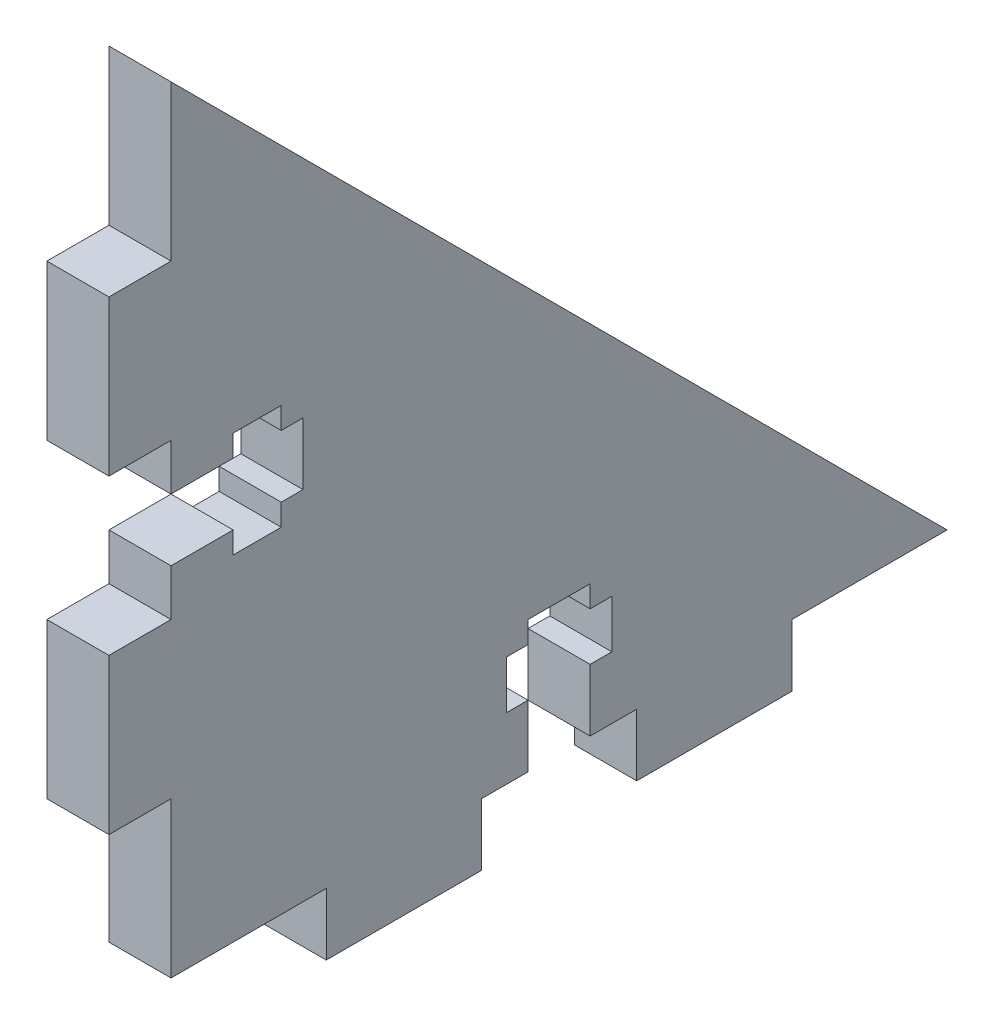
ISO-10303-21;
HEADER;
FILE_DESCRIPTION(('STEP AP214'),'2;1');
FILE_NAME('part.step','',(''),(''),'','','');
FILE_SCHEMA(('AUTOMOTIVE_DESIGN { 1 0 10303 214 1 1 1 1 }'));
ENDSEC;
DATA;
#1=APPLICATION_CONTEXT('core data for automotive mechanical design processes');
#2=APPLICATION_PROTOCOL_DEFINITION('international standard','automotive_design',2000,#1);
#3=PRODUCT_CONTEXT('',#1,'mechanical');
#4=PRODUCT('Part','Part','',(#3));
#5=PRODUCT_RELATED_PRODUCT_CATEGORY('part','',(#4));
#6=PRODUCT_DEFINITION_FORMATION('','',#4);
#7=PRODUCT_DEFINITION_CONTEXT('part definition',#1,'design');
#8=PRODUCT_DEFINITION('design','',#6,#7);
#9=PRODUCT_DEFINITION_SHAPE('','',#8);
#10=(LENGTH_UNIT() NAMED_UNIT(*) SI_UNIT(.MILLI.,.METRE.));
#11=(NAMED_UNIT(*) PLANE_ANGLE_UNIT() SI_UNIT($,.RADIAN.));
#12=(NAMED_UNIT(*) SI_UNIT($,.STERADIAN.) SOLID_ANGLE_UNIT());
#13=UNCERTAINTY_MEASURE_WITH_UNIT(LENGTH_MEASURE(1.E-05),#10,'distance_accuracy_value','');
#14=(GEOMETRIC_REPRESENTATION_CONTEXT(3) GLOBAL_UNCERTAINTY_ASSIGNED_CONTEXT((#13)) GLOBAL_UNIT_ASSIGNED_CONTEXT((#10,
#11,#12)) REPRESENTATION_CONTEXT('',''));
#15=CARTESIAN_POINT('',(0.,0.,0.));
#16=DIRECTION('',(0.,0.,1.));
#17=DIRECTION('',(1.,0.,0.));
#18=AXIS2_PLACEMENT_3D('',#15,#16,#17);
#19=CARTESIAN_POINT('',(-4.,7.1,0.));
#20=DIRECTION('',(0.,1.,0.));
#21=DIRECTION('',(0.,0.,1.));
#22=AXIS2_PLACEMENT_3D('',#19,#20,#21);
#23=PLANE('',#22);
#24=DIRECTION('',(0.,0.,1.));
#25=VECTOR('',#24,1.);
#26=CARTESIAN_POINT('',(0.,7.1,0.));
#27=LINE('',#26,#25);
#28=CARTESIAN_POINT('',(0.,7.1,-23.));
#29=VERTEX_POINT('',#28);
#30=CARTESIAN_POINT('',(0.,7.1,-21.6));
#31=VERTEX_POINT('',#30);
#32=EDGE_CURVE('E349',#29,#31,#27,.T.);
#33=ORIENTED_EDGE('',*,*,#32,.T.);
#34=DIRECTION('',(1.,0.,0.));
#35=VECTOR('',#34,1.);
#36=CARTESIAN_POINT('',(-4.,7.1,-21.6));
#37=LINE('',#36,#35);
#38=CARTESIAN_POINT('',(-4.,7.1,-21.6));
#39=VERTEX_POINT('',#38);
#40=EDGE_CURVE('E11',#39,#31,#37,.T.);
#41=ORIENTED_EDGE('',*,*,#40,.F.);
#42=DIRECTION('',(0.,0.,1.));
#43=VECTOR('',#42,1.);
#44=CARTESIAN_POINT('',(-4.,7.1,0.));
#45=LINE('',#44,#43);
#46=CARTESIAN_POINT('',(-4.,7.1,-23.));
#47=VERTEX_POINT('',#46);
#48=EDGE_CURVE('E454',#47,#39,#45,.T.);
#49=ORIENTED_EDGE('',*,*,#48,.F.);
#50=DIRECTION('',(1.,0.,0.));
#51=VECTOR('',#50,1.);
#52=CARTESIAN_POINT('',(-4.,7.1,-23.));
#53=LINE('',#52,#51);
#54=EDGE_CURVE('E44',#47,#29,#53,.T.);
#55=ORIENTED_EDGE('',*,*,#54,.T.);
#56=EDGE_LOOP('',(#33,#41,#49,#55));
#57=FACE_BOUND('',#56,.T.);
#58=ADVANCED_FACE('F41',(#57),#23,.F.);
#59=CARTESIAN_POINT('',(-4.,0.,-21.6));
#60=DIRECTION('',(0.,0.,1.));
#61=DIRECTION('',(1.,0.,0.));
#62=AXIS2_PLACEMENT_3D('',#59,#60,#61);
#63=PLANE('',#62);
#64=DIRECTION('',(0.,-1.,0.));
#65=VECTOR('',#64,1.);
#66=CARTESIAN_POINT('',(0.,0.,-21.6));
#67=LINE('',#66,#65);
#68=CARTESIAN_POINT('',(0.,4.,-21.6));
#69=VERTEX_POINT('',#68);
#70=EDGE_CURVE('E197',#31,#69,#67,.T.);
#71=ORIENTED_EDGE('',*,*,#70,.T.);
#72=DIRECTION('',(1.,0.,0.));
#73=VECTOR('',#72,1.);
#74=CARTESIAN_POINT('',(-4.,4.,-21.6));
#75=LINE('',#74,#73);
#76=CARTESIAN_POINT('',(-4.,4.,-21.6));
#77=VERTEX_POINT('',#76);
#78=EDGE_CURVE('E50',#77,#69,#75,.T.);
#79=ORIENTED_EDGE('',*,*,#78,.F.);
#80=DIRECTION('',(0.,-1.,0.));
#81=VECTOR('',#80,1.);
#82=CARTESIAN_POINT('',(-4.,0.,-21.6));
#83=LINE('',#82,#81);
#84=EDGE_CURVE('E58',#39,#77,#83,.T.);
#85=ORIENTED_EDGE('',*,*,#84,.F.);
#86=ORIENTED_EDGE('',*,*,#40,.T.);
#87=EDGE_LOOP('',(#71,#79,#85,#86));
#88=FACE_BOUND('',#87,.T.);
#89=ADVANCED_FACE('F563',(#88),#63,.F.);
#90=CARTESIAN_POINT('',(-4.,4.,0.));
#91=DIRECTION('',(0.,1.,0.));
#92=DIRECTION('',(0.,0.,1.));
#93=AXIS2_PLACEMENT_3D('',#90,#91,#92);
#94=PLANE('',#93);
#95=DIRECTION('',(0.,0.,1.));
#96=VECTOR('',#95,1.);
#97=CARTESIAN_POINT('',(0.,4.,0.));
#98=LINE('',#97,#96);
#99=CARTESIAN_POINT('',(0.,4.,-23.));
#100=VERTEX_POINT('',#99);
#101=EDGE_CURVE('E326',#100,#69,#98,.T.);
#102=ORIENTED_EDGE('',*,*,#101,.F.);
#103=DIRECTION('',(1.,0.,0.));
#104=VECTOR('',#103,1.);
#105=CARTESIAN_POINT('',(-4.,4.,-23.));
#106=LINE('',#105,#104);
#107=CARTESIAN_POINT('',(-4.,4.,-23.));
#108=VERTEX_POINT('',#107);
#109=EDGE_CURVE('E322',#108,#100,#106,.T.);
#110=ORIENTED_EDGE('',*,*,#109,.F.);
#111=DIRECTION('',(0.,0.,1.));
#112=VECTOR('',#111,1.);
#113=CARTESIAN_POINT('',(-4.,4.,0.));
#114=LINE('',#113,#112);
#115=EDGE_CURVE('E325',#108,#77,#114,.T.);
#116=ORIENTED_EDGE('',*,*,#115,.T.);
#117=ORIENTED_EDGE('',*,*,#78,.T.);
#118=EDGE_LOOP('',(#102,#110,#116,#117));
#119=FACE_BOUND('',#118,.T.);
#120=ADVANCED_FACE('F324',(#119),#94,.T.);
#121=CARTESIAN_POINT('',(-4.,0.,-23.));
#122=DIRECTION('',(0.,0.,-1.));
#123=DIRECTION('',(0.,1.,0.));
#124=AXIS2_PLACEMENT_3D('',#121,#122,#123);
#125=PLANE('',#124);
#126=DIRECTION('',(0.,1.,0.));
#127=VECTOR('',#126,1.);
#128=CARTESIAN_POINT('',(0.,0.,-23.));
#129=LINE('',#128,#127);
#130=CARTESIAN_POINT('',(0.,0.,-23.));
#131=VERTEX_POINT('',#130);
#132=EDGE_CURVE('E451',#131,#100,#129,.T.);
#133=ORIENTED_EDGE('',*,*,#132,.F.);
#134=DIRECTION('',(1.,0.,0.));
#135=VECTOR('',#134,1.);
#136=CARTESIAN_POINT('',(-4.,0.,-23.));
#137=LINE('',#136,#135);
#138=CARTESIAN_POINT('',(-4.,0.,-23.));
#139=VERTEX_POINT('',#138);
#140=EDGE_CURVE('E331',#139,#131,#137,.T.);
#141=ORIENTED_EDGE('',*,*,#140,.F.);
#142=DIRECTION('',(0.,1.,0.));
#143=VECTOR('',#142,1.);
#144=CARTESIAN_POINT('',(-4.,0.,-23.));
#145=LINE('',#144,#143);
#146=EDGE_CURVE('E336',#139,#108,#145,.T.);
#147=ORIENTED_EDGE('',*,*,#146,.T.);
#148=ORIENTED_EDGE('',*,*,#109,.T.);
#149=EDGE_LOOP('',(#133,#141,#147,#148));
#150=FACE_BOUND('',#149,.T.);
#151=ADVANCED_FACE('F338',(#150),#125,.T.);
#152=CARTESIAN_POINT('',(-4.,0.,0.));
#153=DIRECTION('',(0.,1.,0.));
#154=DIRECTION('',(0.,0.,1.));
#155=AXIS2_PLACEMENT_3D('',#152,#153,#154);
#156=PLANE('',#155);
#157=DIRECTION('',(0.,0.,1.));
#158=VECTOR('',#157,1.);
#159=CARTESIAN_POINT('',(0.,0.,0.));
#160=LINE('',#159,#158);
#161=CARTESIAN_POINT('',(0.,0.,-20.));
#162=VERTEX_POINT('',#161);
#163=EDGE_CURVE('E442',#131,#162,#160,.T.);
#164=ORIENTED_EDGE('',*,*,#163,.T.);
#165=DIRECTION('',(1.,0.,0.));
#166=VECTOR('',#165,1.);
#167=CARTESIAN_POINT('',(-4.,0.,-20.));
#168=LINE('',#167,#166);
#169=CARTESIAN_POINT('',(-4.,0.,-20.));
#170=VERTEX_POINT('',#169);
#171=EDGE_CURVE('E458',#170,#162,#168,.T.);
#172=ORIENTED_EDGE('',*,*,#171,.F.);
#173=DIRECTION('',(0.,0.,1.));
#174=VECTOR('',#173,1.);
#175=CARTESIAN_POINT('',(-4.,0.,0.));
#176=LINE('',#175,#174);
#177=EDGE_CURVE('E340',#139,#170,#176,.T.);
#178=ORIENTED_EDGE('',*,*,#177,.F.);
#179=ORIENTED_EDGE('',*,*,#140,.T.);
#180=EDGE_LOOP('',(#164,#172,#178,#179));
#181=FACE_BOUND('',#180,.T.);
#182=ADVANCED_FACE('F576',(#181),#156,.F.);
#183=CARTESIAN_POINT('',(-4.,0.,-20.));
#184=DIRECTION('',(0.,0.,1.));
#185=DIRECTION('',(0.,-1.,0.));
#186=AXIS2_PLACEMENT_3D('',#183,#184,#185);
#187=PLANE('',#186);
#188=DIRECTION('',(0.,-1.,0.));
#189=VECTOR('',#188,1.);
#190=CARTESIAN_POINT('',(0.,0.,-20.));
#191=LINE('',#190,#189);
#192=CARTESIAN_POINT('',(0.,-4.00000000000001,-20.));
#193=VERTEX_POINT('',#192);
#194=EDGE_CURVE('E448',#162,#193,#191,.T.);
#195=ORIENTED_EDGE('',*,*,#194,.T.);
#196=DIRECTION('',(1.,0.,0.));
#197=VECTOR('',#196,1.);
#198=CARTESIAN_POINT('',(-4.,-4.00000000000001,-20.));
#199=LINE('',#198,#197);
#200=CARTESIAN_POINT('',(-4.,-4.00000000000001,-20.));
#201=VERTEX_POINT('',#200);
#202=EDGE_CURVE('E461',#201,#193,#199,.T.);
#203=ORIENTED_EDGE('',*,*,#202,.F.);
#204=DIRECTION('',(0.,-1.,0.));
#205=VECTOR('',#204,1.);
#206=CARTESIAN_POINT('',(-4.,0.,-20.));
#207=LINE('',#206,#205);
#208=EDGE_CURVE('E342',#170,#201,#207,.T.);
#209=ORIENTED_EDGE('',*,*,#208,.F.);
#210=ORIENTED_EDGE('',*,*,#171,.T.);
#211=EDGE_LOOP('',(#195,#203,#209,#210));
#212=FACE_BOUND('',#211,.T.);
#213=ADVANCED_FACE('F579',(#212),#187,.F.);
#214=CARTESIAN_POINT('',(-4.,-4.00000000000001,0.));
#215=DIRECTION('',(0.,-1.,0.));
#216=DIRECTION('',(0.,0.,-1.));
#217=AXIS2_PLACEMENT_3D('',#214,#215,#216);
#218=PLANE('',#217);
#219=DIRECTION('',(0.,0.,-1.));
#220=VECTOR('',#219,1.);
#221=CARTESIAN_POINT('',(0.,-4.00000000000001,0.));
#222=LINE('',#221,#220);
#223=CARTESIAN_POINT('',(0.,-4.00000000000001,-10.));
#224=VERTEX_POINT('',#223);
#225=EDGE_CURVE('E445',#224,#193,#222,.T.);
#226=ORIENTED_EDGE('',*,*,#225,.F.);
#227=DIRECTION('',(1.,0.,0.));
#228=VECTOR('',#227,1.);
#229=CARTESIAN_POINT('',(-4.,-4.00000000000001,-10.));
#230=LINE('',#229,#228);
#231=CARTESIAN_POINT('',(-4.,-4.00000000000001,-10.));
#232=VERTEX_POINT('',#231);
#233=EDGE_CURVE('E463',#232,#224,#230,.T.);
#234=ORIENTED_EDGE('',*,*,#233,.F.);
#235=DIRECTION('',(0.,0.,-1.));
#236=VECTOR('',#235,1.);
#237=CARTESIAN_POINT('',(-4.,-4.00000000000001,0.));
#238=LINE('',#237,#236);
#239=EDGE_CURVE('E800',#232,#201,#238,.T.);
#240=ORIENTED_EDGE('',*,*,#239,.T.);
#241=ORIENTED_EDGE('',*,*,#202,.T.);
#242=EDGE_LOOP('',(#226,#234,#240,#241));
#243=FACE_BOUND('',#242,.T.);
#244=ADVANCED_FACE('F584',(#243),#218,.T.);
#245=CARTESIAN_POINT('',(-4.,0.,-9.99999999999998));
#246=DIRECTION('',(0.,0.,1.));
#247=DIRECTION('',(0.,-1.,0.));
#248=AXIS2_PLACEMENT_3D('',#245,#246,#247);
#249=PLANE('',#248);
#250=DIRECTION('',(0.,-1.,0.));
#251=VECTOR('',#250,1.);
#252=CARTESIAN_POINT('',(0.,0.,-9.99999999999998));
#253=LINE('',#252,#251);
#254=CARTESIAN_POINT('',(0.,0.,-9.99999999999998));
#255=VERTEX_POINT('',#254);
#256=EDGE_CURVE('E441',#255,#224,#253,.T.);
#257=ORIENTED_EDGE('',*,*,#256,.F.);
#258=DIRECTION('',(1.,0.,0.));
#259=VECTOR('',#258,1.);
#260=CARTESIAN_POINT('',(-4.,0.,-9.99999999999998));
#261=LINE('',#260,#259);
#262=CARTESIAN_POINT('',(-4.,0.,-9.99999999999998));
#263=VERTEX_POINT('',#262);
#264=EDGE_CURVE('E465',#263,#255,#261,.T.);
#265=ORIENTED_EDGE('',*,*,#264,.F.);
#266=DIRECTION('',(0.,-1.,0.));
#267=VECTOR('',#266,1.);
#268=CARTESIAN_POINT('',(-4.,0.,-9.99999999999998));
#269=LINE('',#268,#267);
#270=EDGE_CURVE('E798',#263,#232,#269,.T.);
#271=ORIENTED_EDGE('',*,*,#270,.T.);
#272=ORIENTED_EDGE('',*,*,#233,.T.);
#273=EDGE_LOOP('',(#257,#265,#271,#272));
#274=FACE_BOUND('',#273,.T.);
#275=ADVANCED_FACE('F588',(#274),#249,.T.);
#276=CARTESIAN_POINT('',(0.,0.,0.));
#277=VERTEX_POINT('',#276);
#278=EDGE_CURVE('E439',#255,#277,#160,.T.);
#279=ORIENTED_EDGE('',*,*,#278,.T.);
#280=DIRECTION('',(1.,0.,0.));
#281=VECTOR('',#280,1.);
#282=CARTESIAN_POINT('',(-4.,0.,0.));
#283=LINE('',#282,#281);
#284=CARTESIAN_POINT('',(-4.,0.,0.));
#285=VERTEX_POINT('',#284);
#286=EDGE_CURVE('E467',#285,#277,#283,.T.);
#287=ORIENTED_EDGE('',*,*,#286,.F.);
#288=EDGE_CURVE('E344',#263,#285,#176,.T.);
#289=ORIENTED_EDGE('',*,*,#288,.F.);
#290=ORIENTED_EDGE('',*,*,#264,.T.);
#291=EDGE_LOOP('',(#279,#287,#289,#290));
#292=FACE_BOUND('',#291,.T.);
#293=ADVANCED_FACE('F581',(#292),#156,.F.);
#294=CARTESIAN_POINT('',(-4.,0.,0.));
#295=DIRECTION('',(0.,0.,-1.));
#296=DIRECTION('',(-1.,0.,0.));
#297=AXIS2_PLACEMENT_3D('',#294,#295,#296);
#298=PLANE('',#297);
#299=DIRECTION('',(0.,1.,0.));
#300=VECTOR('',#299,1.);
#301=CARTESIAN_POINT('',(0.,0.,0.));
#302=LINE('',#301,#300);
#303=CARTESIAN_POINT('',(0.,10.,0.));
#304=VERTEX_POINT('',#303);
#305=EDGE_CURVE('E431',#277,#304,#302,.T.);
#306=ORIENTED_EDGE('',*,*,#305,.T.);
#307=DIRECTION('',(1.,0.,0.));
#308=VECTOR('',#307,1.);
#309=CARTESIAN_POINT('',(-4.,10.,0.));
#310=LINE('',#309,#308);
#311=CARTESIAN_POINT('',(-4.,10.,0.));
#312=VERTEX_POINT('',#311);
#313=EDGE_CURVE('E470',#312,#304,#310,.T.);
#314=ORIENTED_EDGE('',*,*,#313,.F.);
#315=DIRECTION('',(0.,1.,0.));
#316=VECTOR('',#315,1.);
#317=CARTESIAN_POINT('',(-4.,0.,0.));
#318=LINE('',#317,#316);
#319=EDGE_CURVE('E791',#285,#312,#318,.T.);
#320=ORIENTED_EDGE('',*,*,#319,.F.);
#321=ORIENTED_EDGE('',*,*,#286,.T.);
#322=EDGE_LOOP('',(#306,#314,#320,#321));
#323=FACE_BOUND('',#322,.T.);
#324=ADVANCED_FACE('F593',(#323),#298,.F.);
#325=CARTESIAN_POINT('',(-4.,10.,0.));
#326=DIRECTION('',(0.,1.,0.));
#327=DIRECTION('',(0.,0.,1.));
#328=AXIS2_PLACEMENT_3D('',#325,#326,#327);
#329=PLANE('',#328);
#330=DIRECTION('',(0.,0.,1.));
#331=VECTOR('',#330,1.);
#332=CARTESIAN_POINT('',(0.,10.,0.));
#333=LINE('',#332,#331);
#334=CARTESIAN_POINT('',(0.,10.,4.));
#335=VERTEX_POINT('',#334);
#336=EDGE_CURVE('E437',#304,#335,#333,.T.);
#337=ORIENTED_EDGE('',*,*,#336,.T.);
#338=DIRECTION('',(1.,0.,0.));
#339=VECTOR('',#338,1.);
#340=CARTESIAN_POINT('',(-4.,10.,4.));
#341=LINE('',#340,#339);
#342=CARTESIAN_POINT('',(-4.,10.,4.));
#343=VERTEX_POINT('',#342);
#344=EDGE_CURVE('E473',#343,#335,#341,.T.);
#345=ORIENTED_EDGE('',*,*,#344,.F.);
#346=DIRECTION('',(0.,0.,1.));
#347=VECTOR('',#346,1.);
#348=CARTESIAN_POINT('',(-4.,10.,0.));
#349=LINE('',#348,#347);
#350=EDGE_CURVE('E796',#312,#343,#349,.T.);
#351=ORIENTED_EDGE('',*,*,#350,.F.);
#352=ORIENTED_EDGE('',*,*,#313,.T.);
#353=EDGE_LOOP('',(#337,#345,#351,#352));
#354=FACE_BOUND('',#353,.T.);
#355=ADVANCED_FACE('F596',(#354),#329,.F.);
#356=CARTESIAN_POINT('',(-4.,0.,4.));
#357=DIRECTION('',(0.,0.,-1.));
#358=DIRECTION('',(-1.,0.,0.));
#359=AXIS2_PLACEMENT_3D('',#356,#357,#358);
#360=PLANE('',#359);
#361=DIRECTION('',(0.,1.,0.));
#362=VECTOR('',#361,1.);
#363=CARTESIAN_POINT('',(0.,0.,4.));
#364=LINE('',#363,#362);
#365=CARTESIAN_POINT('',(0.,20.,4.));
#366=VERTEX_POINT('',#365);
#367=EDGE_CURVE('E434',#335,#366,#364,.T.);
#368=ORIENTED_EDGE('',*,*,#367,.T.);
#369=DIRECTION('',(1.,0.,0.));
#370=VECTOR('',#369,1.);
#371=CARTESIAN_POINT('',(-4.,20.,4.));
#372=LINE('',#371,#370);
#373=CARTESIAN_POINT('',(-4.,20.,4.));
#374=VERTEX_POINT('',#373);
#375=EDGE_CURVE('E476',#374,#366,#372,.T.);
#376=ORIENTED_EDGE('',*,*,#375,.F.);
#377=DIRECTION('',(0.,1.,0.));
#378=VECTOR('',#377,1.);
#379=CARTESIAN_POINT('',(-4.,0.,4.));
#380=LINE('',#379,#378);
#381=EDGE_CURVE('E794',#343,#374,#380,.T.);
#382=ORIENTED_EDGE('',*,*,#381,.F.);
#383=ORIENTED_EDGE('',*,*,#344,.T.);
#384=EDGE_LOOP('',(#368,#376,#382,#383));
#385=FACE_BOUND('',#384,.T.);
#386=ADVANCED_FACE('F601',(#385),#360,.F.);
#387=CARTESIAN_POINT('',(-4.,20.,0.));
#388=DIRECTION('',(0.,1.,0.));
#389=DIRECTION('',(0.,0.,1.));
#390=AXIS2_PLACEMENT_3D('',#387,#388,#389);
#391=PLANE('',#390);
#392=DIRECTION('',(0.,0.,1.));
#393=VECTOR('',#392,1.);
#394=CARTESIAN_POINT('',(0.,20.,0.));
#395=LINE('',#394,#393);
#396=CARTESIAN_POINT('',(0.,20.,0.));
#397=VERTEX_POINT('',#396);
#398=EDGE_CURVE('E430',#397,#366,#395,.T.);
#399=ORIENTED_EDGE('',*,*,#398,.F.);
#400=DIRECTION('',(1.,0.,0.));
#401=VECTOR('',#400,1.);
#402=CARTESIAN_POINT('',(-4.,20.,0.));
#403=LINE('',#402,#401);
#404=CARTESIAN_POINT('',(-4.,20.,0.));
#405=VERTEX_POINT('',#404);
#406=EDGE_CURVE('E478',#405,#397,#403,.T.);
#407=ORIENTED_EDGE('',*,*,#406,.F.);
#408=DIRECTION('',(0.,0.,1.));
#409=VECTOR('',#408,1.);
#410=CARTESIAN_POINT('',(-4.,20.,0.));
#411=LINE('',#410,#409);
#412=EDGE_CURVE('E790',#405,#374,#411,.T.);
#413=ORIENTED_EDGE('',*,*,#412,.T.);
#414=ORIENTED_EDGE('',*,*,#375,.T.);
#415=EDGE_LOOP('',(#399,#407,#413,#414));
#416=FACE_BOUND('',#415,.T.);
#417=ADVANCED_FACE('F605',(#416),#391,.T.);
#418=CARTESIAN_POINT('',(0.,23.,0.));
#419=VERTEX_POINT('',#418);
#420=EDGE_CURVE('E428',#397,#419,#302,.T.);
#421=ORIENTED_EDGE('',*,*,#420,.T.);
#422=DIRECTION('',(1.,0.,0.));
#423=VECTOR('',#422,1.);
#424=CARTESIAN_POINT('',(-4.,23.,0.));
#425=LINE('',#424,#423);
#426=CARTESIAN_POINT('',(-4.,23.,0.));
#427=VERTEX_POINT('',#426);
#428=EDGE_CURVE('E480',#427,#419,#425,.T.);
#429=ORIENTED_EDGE('',*,*,#428,.F.);
#430=EDGE_CURVE('E788',#405,#427,#318,.T.);
#431=ORIENTED_EDGE('',*,*,#430,.F.);
#432=ORIENTED_EDGE('',*,*,#406,.T.);
#433=EDGE_LOOP('',(#421,#429,#431,#432));
#434=FACE_BOUND('',#433,.T.);
#435=ADVANCED_FACE('F598',(#434),#298,.F.);
#436=CARTESIAN_POINT('',(-4.,23.,0.));
#437=DIRECTION('',(0.,-1.,0.));
#438=DIRECTION('',(0.,0.,-1.));
#439=AXIS2_PLACEMENT_3D('',#436,#437,#438);
#440=PLANE('',#439);
#441=DIRECTION('',(0.,0.,-1.));
#442=VECTOR('',#441,1.);
#443=CARTESIAN_POINT('',(0.,23.,0.));
#444=LINE('',#443,#442);
#445=CARTESIAN_POINT('',(0.,23.,-4.));
#446=VERTEX_POINT('',#445);
#447=EDGE_CURVE('E426',#419,#446,#444,.T.);
#448=ORIENTED_EDGE('',*,*,#447,.T.);
#449=DIRECTION('',(1.,0.,0.));
#450=VECTOR('',#449,1.);
#451=CARTESIAN_POINT('',(-4.,23.,-4.));
#452=LINE('',#451,#450);
#453=CARTESIAN_POINT('',(-4.,23.,-4.));
#454=VERTEX_POINT('',#453);
#455=EDGE_CURVE('E483',#454,#446,#452,.T.);
#456=ORIENTED_EDGE('',*,*,#455,.F.);
#457=DIRECTION('',(0.,0.,-1.));
#458=VECTOR('',#457,1.);
#459=CARTESIAN_POINT('',(-4.,23.,0.));
#460=LINE('',#459,#458);
#461=EDGE_CURVE('E786',#427,#454,#460,.T.);
#462=ORIENTED_EDGE('',*,*,#461,.F.);
#463=ORIENTED_EDGE('',*,*,#428,.T.);
#464=EDGE_LOOP('',(#448,#456,#462,#463));
#465=FACE_BOUND('',#464,.T.);
#466=ADVANCED_FACE('F610',(#465),#440,.F.);
#467=CARTESIAN_POINT('',(-4.,0.,-4.));
#468=DIRECTION('',(0.,0.,1.));
#469=DIRECTION('',(1.,0.,0.));
#470=AXIS2_PLACEMENT_3D('',#467,#468,#469);
#471=PLANE('',#470);
#472=DIRECTION('',(0.,-1.,0.));
#473=VECTOR('',#472,1.);
#474=CARTESIAN_POINT('',(0.,0.,-4.));
#475=LINE('',#474,#473);
#476=CARTESIAN_POINT('',(0.,21.6,-4.));
#477=VERTEX_POINT('',#476);
#478=EDGE_CURVE('E424',#446,#477,#475,.T.);
#479=ORIENTED_EDGE('',*,*,#478,.T.);
#480=DIRECTION('',(1.,0.,0.));
#481=VECTOR('',#480,1.);
#482=CARTESIAN_POINT('',(-4.,21.6,-4.));
#483=LINE('',#482,#481);
#484=CARTESIAN_POINT('',(-4.,21.6,-4.));
#485=VERTEX_POINT('',#484);
#486=EDGE_CURVE('E486',#485,#477,#483,.T.);
#487=ORIENTED_EDGE('',*,*,#486,.F.);
#488=DIRECTION('',(0.,-1.,0.));
#489=VECTOR('',#488,1.);
#490=CARTESIAN_POINT('',(-4.,0.,-4.));
#491=LINE('',#490,#489);
#492=EDGE_CURVE('E784',#454,#485,#491,.T.);
#493=ORIENTED_EDGE('',*,*,#492,.F.);
#494=ORIENTED_EDGE('',*,*,#455,.T.);
#495=EDGE_LOOP('',(#479,#487,#493,#494));
#496=FACE_BOUND('',#495,.T.);
#497=ADVANCED_FACE('F613',(#496),#471,.F.);
#498=CARTESIAN_POINT('',(-4.,21.6,0.));
#499=DIRECTION('',(0.,-1.,0.));
#500=DIRECTION('',(0.,0.,-1.));
#501=AXIS2_PLACEMENT_3D('',#498,#499,#500);
#502=PLANE('',#501);
#503=DIRECTION('',(0.,0.,-1.));
#504=VECTOR('',#503,1.);
#505=CARTESIAN_POINT('',(0.,21.6,0.));
#506=LINE('',#505,#504);
#507=CARTESIAN_POINT('',(0.,21.6,-7.1));
#508=VERTEX_POINT('',#507);
#509=EDGE_CURVE('E421',#477,#508,#506,.T.);
#510=ORIENTED_EDGE('',*,*,#509,.T.);
#511=DIRECTION('',(1.,0.,0.));
#512=VECTOR('',#511,1.);
#513=CARTESIAN_POINT('',(-4.,21.6,-7.1));
#514=LINE('',#513,#512);
#515=CARTESIAN_POINT('',(-4.,21.6,-7.1));
#516=VERTEX_POINT('',#515);
#517=EDGE_CURVE('E489',#516,#508,#514,.T.);
#518=ORIENTED_EDGE('',*,*,#517,.F.);
#519=DIRECTION('',(0.,0.,-1.));
#520=VECTOR('',#519,1.);
#521=CARTESIAN_POINT('',(-4.,21.6,0.));
#522=LINE('',#521,#520);
#523=EDGE_CURVE('E782',#485,#516,#522,.T.);
#524=ORIENTED_EDGE('',*,*,#523,.F.);
#525=ORIENTED_EDGE('',*,*,#486,.T.);
#526=EDGE_LOOP('',(#510,#518,#524,#525));
#527=FACE_BOUND('',#526,.T.);
#528=ADVANCED_FACE('F617',(#527),#502,.F.);
#529=CARTESIAN_POINT('',(-4.,0.,-7.1));
#530=DIRECTION('',(0.,0.,1.));
#531=DIRECTION('',(1.,0.,0.));
#532=AXIS2_PLACEMENT_3D('',#529,#530,#531);
#533=PLANE('',#532);
#534=DIRECTION('',(0.,-1.,0.));
#535=VECTOR('',#534,1.);
#536=CARTESIAN_POINT('',(0.,0.,-7.1));
#537=LINE('',#536,#535);
#538=CARTESIAN_POINT('',(0.,23.,-7.1));
#539=VERTEX_POINT('',#538);
#540=EDGE_CURVE('E418',#539,#508,#537,.T.);
#541=ORIENTED_EDGE('',*,*,#540,.F.);
#542=DIRECTION('',(1.,0.,0.));
#543=VECTOR('',#542,1.);
#544=CARTESIAN_POINT('',(-4.,23.,-7.1));
#545=LINE('',#544,#543);
#546=CARTESIAN_POINT('',(-4.,23.,-7.1));
#547=VERTEX_POINT('',#546);
#548=EDGE_CURVE('E491',#547,#539,#545,.T.);
#549=ORIENTED_EDGE('',*,*,#548,.F.);
#550=DIRECTION('',(0.,-1.,0.));
#551=VECTOR('',#550,1.);
#552=CARTESIAN_POINT('',(-4.,0.,-7.1));
#553=LINE('',#552,#551);
#554=EDGE_CURVE('E779',#547,#516,#553,.T.);
#555=ORIENTED_EDGE('',*,*,#554,.T.);
#556=ORIENTED_EDGE('',*,*,#517,.T.);
#557=EDGE_LOOP('',(#541,#549,#555,#556));
#558=FACE_BOUND('',#557,.T.);
#559=ADVANCED_FACE('F621',(#558),#533,.T.);
#560=CARTESIAN_POINT('',(-4.,23.,0.));
#561=DIRECTION('',(0.,-1.,0.));
#562=DIRECTION('',(0.,0.,-1.));
#563=AXIS2_PLACEMENT_3D('',#560,#561,#562);
#564=PLANE('',#563);
#565=DIRECTION('',(0.,0.,-1.));
#566=VECTOR('',#565,1.);
#567=CARTESIAN_POINT('',(0.,23.,0.));
#568=LINE('',#567,#566);
#569=CARTESIAN_POINT('',(0.,23.,-8.5));
#570=VERTEX_POINT('',#569);
#571=EDGE_CURVE('E415',#539,#570,#568,.T.);
#572=ORIENTED_EDGE('',*,*,#571,.T.);
#573=DIRECTION('',(1.,0.,0.));
#574=VECTOR('',#573,1.);
#575=CARTESIAN_POINT('',(-4.,23.,-8.5));
#576=LINE('',#575,#574);
#577=CARTESIAN_POINT('',(-4.,23.,-8.5));
#578=VERTEX_POINT('',#577);
#579=EDGE_CURVE('E493',#578,#570,#576,.T.);
#580=ORIENTED_EDGE('',*,*,#579,.F.);
#581=DIRECTION('',(0.,0.,-1.));
#582=VECTOR('',#581,1.);
#583=CARTESIAN_POINT('',(-4.,23.,0.));
#584=LINE('',#583,#582);
#585=EDGE_CURVE('E777',#547,#578,#584,.T.);
#586=ORIENTED_EDGE('',*,*,#585,.F.);
#587=ORIENTED_EDGE('',*,*,#548,.T.);
#588=EDGE_LOOP('',(#572,#580,#586,#587));
#589=FACE_BOUND('',#588,.T.);
#590=ADVANCED_FACE('F625',(#589),#564,.F.);
#591=CARTESIAN_POINT('',(-4.,0.,-8.5));
#592=DIRECTION('',(0.,0.,1.));
#593=DIRECTION('',(1.,0.,0.));
#594=AXIS2_PLACEMENT_3D('',#591,#592,#593);
#595=PLANE('',#594);
#596=DIRECTION('',(0.,-1.,0.));
#597=VECTOR('',#596,1.);
#598=CARTESIAN_POINT('',(0.,0.,-8.5));
#599=LINE('',#598,#597);
#600=CARTESIAN_POINT('',(0.,27.,-8.5));
#601=VERTEX_POINT('',#600);
#602=EDGE_CURVE('E412',#601,#570,#599,.T.);
#603=ORIENTED_EDGE('',*,*,#602,.F.);
#604=DIRECTION('',(1.,0.,0.));
#605=VECTOR('',#604,1.);
#606=CARTESIAN_POINT('',(-4.,27.,-8.5));
#607=LINE('',#606,#605);
#608=CARTESIAN_POINT('',(-4.,27.,-8.5));
#609=VERTEX_POINT('',#608);
#610=EDGE_CURVE('E495',#609,#601,#607,.T.);
#611=ORIENTED_EDGE('',*,*,#610,.F.);
#612=DIRECTION('',(0.,-1.,0.));
#613=VECTOR('',#612,1.);
#614=CARTESIAN_POINT('',(-4.,0.,-8.5));
#615=LINE('',#614,#613);
#616=EDGE_CURVE('E774',#609,#578,#615,.T.);
#617=ORIENTED_EDGE('',*,*,#616,.T.);
#618=ORIENTED_EDGE('',*,*,#579,.T.);
#619=EDGE_LOOP('',(#603,#611,#617,#618));
#620=FACE_BOUND('',#619,.T.);
#621=ADVANCED_FACE('F629',(#620),#595,.T.);
#622=CARTESIAN_POINT('',(-4.,27.,0.));
#623=DIRECTION('',(0.,-1.,0.));
#624=DIRECTION('',(0.,0.,-1.));
#625=AXIS2_PLACEMENT_3D('',#622,#623,#624);
#626=PLANE('',#625);
#627=DIRECTION('',(0.,0.,-1.));
#628=VECTOR('',#627,1.);
#629=CARTESIAN_POINT('',(0.,27.,0.));
#630=LINE('',#629,#628);
#631=CARTESIAN_POINT('',(0.,27.,-7.1));
#632=VERTEX_POINT('',#631);
#633=EDGE_CURVE('E409',#632,#601,#630,.T.);
#634=ORIENTED_EDGE('',*,*,#633,.F.);
#635=DIRECTION('',(1.,0.,0.));
#636=VECTOR('',#635,1.);
#637=CARTESIAN_POINT('',(-4.,27.,-7.1));
#638=LINE('',#637,#636);
#639=CARTESIAN_POINT('',(-4.,27.,-7.1));
#640=VERTEX_POINT('',#639);
#641=EDGE_CURVE('E497',#640,#632,#638,.T.);
#642=ORIENTED_EDGE('',*,*,#641,.F.);
#643=DIRECTION('',(0.,0.,-1.));
#644=VECTOR('',#643,1.);
#645=CARTESIAN_POINT('',(-4.,27.,0.));
#646=LINE('',#645,#644);
#647=EDGE_CURVE('E771',#640,#609,#646,.T.);
#648=ORIENTED_EDGE('',*,*,#647,.T.);
#649=ORIENTED_EDGE('',*,*,#610,.T.);
#650=EDGE_LOOP('',(#634,#642,#648,#649));
#651=FACE_BOUND('',#650,.T.);
#652=ADVANCED_FACE('F633',(#651),#626,.T.);
#653=CARTESIAN_POINT('',(-4.,0.,-7.1));
#654=DIRECTION('',(0.,0.,1.));
#655=DIRECTION('',(1.,0.,0.));
#656=AXIS2_PLACEMENT_3D('',#653,#654,#655);
#657=PLANE('',#656);
#658=DIRECTION('',(0.,-1.,0.));
#659=VECTOR('',#658,1.);
#660=CARTESIAN_POINT('',(0.,0.,-7.1));
#661=LINE('',#660,#659);
#662=CARTESIAN_POINT('',(0.,28.4,-7.1));
#663=VERTEX_POINT('',#662);
#664=EDGE_CURVE('E406',#663,#632,#661,.T.);
#665=ORIENTED_EDGE('',*,*,#664,.F.);
#666=DIRECTION('',(1.,0.,0.));
#667=VECTOR('',#666,1.);
#668=CARTESIAN_POINT('',(-4.,28.4,-7.1));
#669=LINE('',#668,#667);
#670=CARTESIAN_POINT('',(-4.,28.4,-7.1));
#671=VERTEX_POINT('',#670);
#672=EDGE_CURVE('E499',#671,#663,#669,.T.);
#673=ORIENTED_EDGE('',*,*,#672,.F.);
#674=DIRECTION('',(0.,-1.,0.));
#675=VECTOR('',#674,1.);
#676=CARTESIAN_POINT('',(-4.,0.,-7.1));
#677=LINE('',#676,#675);
#678=EDGE_CURVE('E768',#671,#640,#677,.T.);
#679=ORIENTED_EDGE('',*,*,#678,.T.);
#680=ORIENTED_EDGE('',*,*,#641,.T.);
#681=EDGE_LOOP('',(#665,#673,#679,#680));
#682=FACE_BOUND('',#681,.T.);
#683=ADVANCED_FACE('F637',(#682),#657,.T.);
#684=CARTESIAN_POINT('',(-4.,28.4,0.));
#685=DIRECTION('',(0.,-1.,0.));
#686=DIRECTION('',(0.,0.,-1.));
#687=AXIS2_PLACEMENT_3D('',#684,#685,#686);
#688=PLANE('',#687);
#689=DIRECTION('',(0.,0.,-1.));
#690=VECTOR('',#689,1.);
#691=CARTESIAN_POINT('',(0.,28.4,0.));
#692=LINE('',#691,#690);
#693=CARTESIAN_POINT('',(0.,28.4,-4.));
#694=VERTEX_POINT('',#693);
#695=EDGE_CURVE('E403',#694,#663,#692,.T.);
#696=ORIENTED_EDGE('',*,*,#695,.F.);
#697=DIRECTION('',(1.,0.,0.));
#698=VECTOR('',#697,1.);
#699=CARTESIAN_POINT('',(-4.,28.4,-4.));
#700=LINE('',#699,#698);
#701=CARTESIAN_POINT('',(-4.,28.4,-4.));
#702=VERTEX_POINT('',#701);
#703=EDGE_CURVE('E501',#702,#694,#700,.T.);
#704=ORIENTED_EDGE('',*,*,#703,.F.);
#705=DIRECTION('',(0.,0.,-1.));
#706=VECTOR('',#705,1.);
#707=CARTESIAN_POINT('',(-4.,28.4,0.));
#708=LINE('',#707,#706);
#709=EDGE_CURVE('E765',#702,#671,#708,.T.);
#710=ORIENTED_EDGE('',*,*,#709,.T.);
#711=ORIENTED_EDGE('',*,*,#672,.T.);
#712=EDGE_LOOP('',(#696,#704,#710,#711));
#713=FACE_BOUND('',#712,.T.);
#714=ADVANCED_FACE('F641',(#713),#688,.T.);
#715=CARTESIAN_POINT('',(-4.,0.,-4.));
#716=DIRECTION('',(0.,0.,1.));
#717=DIRECTION('',(1.,0.,0.));
#718=AXIS2_PLACEMENT_3D('',#715,#716,#717);
#719=PLANE('',#718);
#720=DIRECTION('',(0.,-1.,0.));
#721=VECTOR('',#720,1.);
#722=CARTESIAN_POINT('',(0.,0.,-4.));
#723=LINE('',#722,#721);
#724=CARTESIAN_POINT('',(0.,27.,-4.));
#725=VERTEX_POINT('',#724);
#726=EDGE_CURVE('E400',#694,#725,#723,.T.);
#727=ORIENTED_EDGE('',*,*,#726,.T.);
#728=DIRECTION('',(1.,0.,0.));
#729=VECTOR('',#728,1.);
#730=CARTESIAN_POINT('',(-4.,27.,-4.));
#731=LINE('',#730,#729);
#732=CARTESIAN_POINT('',(-4.,27.,-4.));
#733=VERTEX_POINT('',#732);
#734=EDGE_CURVE('E503',#733,#725,#731,.T.);
#735=ORIENTED_EDGE('',*,*,#734,.F.);
#736=DIRECTION('',(0.,-1.,0.));
#737=VECTOR('',#736,1.);
#738=CARTESIAN_POINT('',(-4.,0.,-4.));
#739=LINE('',#738,#737);
#740=EDGE_CURVE('E763',#702,#733,#739,.T.);
#741=ORIENTED_EDGE('',*,*,#740,.F.);
#742=ORIENTED_EDGE('',*,*,#703,.T.);
#743=EDGE_LOOP('',(#727,#735,#741,#742));
#744=FACE_BOUND('',#743,.T.);
#745=ADVANCED_FACE('F645',(#744),#719,.F.);
#746=CARTESIAN_POINT('',(-4.,27.,0.));
#747=DIRECTION('',(0.,-1.,0.));
#748=DIRECTION('',(0.,0.,-1.));
#749=AXIS2_PLACEMENT_3D('',#746,#747,#748);
#750=PLANE('',#749);
#751=DIRECTION('',(0.,0.,-1.));
#752=VECTOR('',#751,1.);
#753=CARTESIAN_POINT('',(0.,27.,0.));
#754=LINE('',#753,#752);
#755=CARTESIAN_POINT('',(0.,27.,0.));
#756=VERTEX_POINT('',#755);
#757=EDGE_CURVE('E397',#756,#725,#754,.T.);
#758=ORIENTED_EDGE('',*,*,#757,.F.);
#759=DIRECTION('',(1.,0.,0.));
#760=VECTOR('',#759,1.);
#761=CARTESIAN_POINT('',(-4.,27.,0.));
#762=LINE('',#761,#760);
#763=CARTESIAN_POINT('',(-4.,27.,0.));
#764=VERTEX_POINT('',#763);
#765=EDGE_CURVE('E505',#764,#756,#762,.T.);
#766=ORIENTED_EDGE('',*,*,#765,.F.);
#767=DIRECTION('',(0.,0.,-1.));
#768=VECTOR('',#767,1.);
#769=CARTESIAN_POINT('',(-4.,27.,0.));
#770=LINE('',#769,#768);
#771=EDGE_CURVE('E760',#764,#733,#770,.T.);
#772=ORIENTED_EDGE('',*,*,#771,.T.);
#773=ORIENTED_EDGE('',*,*,#734,.T.);
#774=EDGE_LOOP('',(#758,#766,#772,#773));
#775=FACE_BOUND('',#774,.T.);
#776=ADVANCED_FACE('F649',(#775),#750,.T.);
#777=CARTESIAN_POINT('',(-4.,0.,-2.01340702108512E-13));
#778=DIRECTION('',(0.,0.,-1.));
#779=DIRECTION('',(0.,1.,0.));
#780=AXIS2_PLACEMENT_3D('',#777,#778,#779);
#781=PLANE('',#780);
#782=DIRECTION('',(0.,1.,0.));
#783=VECTOR('',#782,1.);
#784=CARTESIAN_POINT('',(0.,0.,-2.01340702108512E-13));
#785=LINE('',#784,#783);
#786=CARTESIAN_POINT('',(0.,30.,0.));
#787=VERTEX_POINT('',#786);
#788=EDGE_CURVE('E389',#756,#787,#785,.T.);
#789=ORIENTED_EDGE('',*,*,#788,.T.);
#790=DIRECTION('',(1.,0.,0.));
#791=VECTOR('',#790,1.);
#792=CARTESIAN_POINT('',(-4.,30.,0.));
#793=LINE('',#792,#791);
#794=CARTESIAN_POINT('',(-4.,30.,0.));
#795=VERTEX_POINT('',#794);
#796=EDGE_CURVE('E507',#795,#787,#793,.T.);
#797=ORIENTED_EDGE('',*,*,#796,.F.);
#798=DIRECTION('',(0.,1.,0.));
#799=VECTOR('',#798,1.);
#800=CARTESIAN_POINT('',(-4.,0.,-2.01340702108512E-13));
#801=LINE('',#800,#799);
#802=EDGE_CURVE('E753',#764,#795,#801,.T.);
#803=ORIENTED_EDGE('',*,*,#802,.F.);
#804=ORIENTED_EDGE('',*,*,#765,.T.);
#805=EDGE_LOOP('',(#789,#797,#803,#804));
#806=FACE_BOUND('',#805,.T.);
#807=ADVANCED_FACE('F653',(#806),#781,.F.);
#808=CARTESIAN_POINT('',(-4.,30.,0.));
#809=DIRECTION('',(0.,1.,0.));
#810=DIRECTION('',(0.,0.,1.));
#811=AXIS2_PLACEMENT_3D('',#808,#809,#810);
#812=PLANE('',#811);
#813=DIRECTION('',(0.,0.,1.));
#814=VECTOR('',#813,1.);
#815=CARTESIAN_POINT('',(0.,30.,0.));
#816=LINE('',#815,#814);
#817=CARTESIAN_POINT('',(0.,30.,4.00000000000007));
#818=VERTEX_POINT('',#817);
#819=EDGE_CURVE('E395',#787,#818,#816,.T.);
#820=ORIENTED_EDGE('',*,*,#819,.T.);
#821=DIRECTION('',(1.,0.,0.));
#822=VECTOR('',#821,1.);
#823=CARTESIAN_POINT('',(-4.,30.,4.00000000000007));
#824=LINE('',#823,#822);
#825=CARTESIAN_POINT('',(-4.,30.,4.00000000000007));
#826=VERTEX_POINT('',#825);
#827=EDGE_CURVE('E510',#826,#818,#824,.T.);
#828=ORIENTED_EDGE('',*,*,#827,.F.);
#829=DIRECTION('',(0.,0.,1.));
#830=VECTOR('',#829,1.);
#831=CARTESIAN_POINT('',(-4.,30.,0.));
#832=LINE('',#831,#830);
#833=EDGE_CURVE('E758',#795,#826,#832,.T.);
#834=ORIENTED_EDGE('',*,*,#833,.F.);
#835=ORIENTED_EDGE('',*,*,#796,.T.);
#836=EDGE_LOOP('',(#820,#828,#834,#835));
#837=FACE_BOUND('',#836,.T.);
#838=ADVANCED_FACE('F657',(#837),#812,.F.);
#839=CARTESIAN_POINT('',(-4.,0.,4.00000000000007));
#840=DIRECTION('',(0.,0.,-1.));
#841=DIRECTION('',(-1.,0.,0.));
#842=AXIS2_PLACEMENT_3D('',#839,#840,#841);
#843=PLANE('',#842);
#844=DIRECTION('',(0.,1.,0.));
#845=VECTOR('',#844,1.);
#846=CARTESIAN_POINT('',(0.,0.,4.00000000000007));
#847=LINE('',#846,#845);
#848=CARTESIAN_POINT('',(0.,40.,4.00000000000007));
#849=VERTEX_POINT('',#848);
#850=EDGE_CURVE('E392',#818,#849,#847,.T.);
#851=ORIENTED_EDGE('',*,*,#850,.T.);
#852=DIRECTION('',(1.,0.,0.));
#853=VECTOR('',#852,1.);
#854=CARTESIAN_POINT('',(-4.,40.,4.00000000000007));
#855=LINE('',#854,#853);
#856=CARTESIAN_POINT('',(-4.,40.,4.00000000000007));
#857=VERTEX_POINT('',#856);
#858=EDGE_CURVE('E513',#857,#849,#855,.T.);
#859=ORIENTED_EDGE('',*,*,#858,.F.);
#860=DIRECTION('',(0.,1.,0.));
#861=VECTOR('',#860,1.);
#862=CARTESIAN_POINT('',(-4.,0.,4.00000000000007));
#863=LINE('',#862,#861);
#864=EDGE_CURVE('E756',#826,#857,#863,.T.);
#865=ORIENTED_EDGE('',*,*,#864,.F.);
#866=ORIENTED_EDGE('',*,*,#827,.T.);
#867=EDGE_LOOP('',(#851,#859,#865,#866));
#868=FACE_BOUND('',#867,.T.);
#869=ADVANCED_FACE('F662',(#868),#843,.F.);
#870=CARTESIAN_POINT('',(-4.,40.,0.));
#871=DIRECTION('',(0.,1.,0.));
#872=DIRECTION('',(0.,0.,1.));
#873=AXIS2_PLACEMENT_3D('',#870,#871,#872);
#874=PLANE('',#873);
#875=DIRECTION('',(0.,0.,1.));
#876=VECTOR('',#875,1.);
#877=CARTESIAN_POINT('',(0.,40.,0.));
#878=LINE('',#877,#876);
#879=CARTESIAN_POINT('',(0.,40.,0.));
#880=VERTEX_POINT('',#879);
#881=EDGE_CURVE('E388',#880,#849,#878,.T.);
#882=ORIENTED_EDGE('',*,*,#881,.F.);
#883=DIRECTION('',(1.,0.,0.));
#884=VECTOR('',#883,1.);
#885=CARTESIAN_POINT('',(-4.,40.,0.));
#886=LINE('',#885,#884);
#887=CARTESIAN_POINT('',(-4.,40.,0.));
#888=VERTEX_POINT('',#887);
#889=EDGE_CURVE('E515',#888,#880,#886,.T.);
#890=ORIENTED_EDGE('',*,*,#889,.F.);
#891=DIRECTION('',(0.,0.,1.));
#892=VECTOR('',#891,1.);
#893=CARTESIAN_POINT('',(-4.,40.,0.));
#894=LINE('',#893,#892);
#895=EDGE_CURVE('E752',#888,#857,#894,.T.);
#896=ORIENTED_EDGE('',*,*,#895,.T.);
#897=ORIENTED_EDGE('',*,*,#858,.T.);
#898=EDGE_LOOP('',(#882,#890,#896,#897));
#899=FACE_BOUND('',#898,.T.);
#900=ADVANCED_FACE('F666',(#899),#874,.T.);
#901=CARTESIAN_POINT('',(0.,50.,1.66533453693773E-13));
#902=VERTEX_POINT('',#901);
#903=EDGE_CURVE('E386',#880,#902,#785,.T.);
#904=ORIENTED_EDGE('',*,*,#903,.T.);
#905=DIRECTION('',(1.,0.,0.));
#906=VECTOR('',#905,1.);
#907=CARTESIAN_POINT('',(-4.,50.,1.66533453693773E-13));
#908=LINE('',#907,#906);
#909=CARTESIAN_POINT('',(-4.,50.,1.66533453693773E-13));
#910=VERTEX_POINT('',#909);
#911=EDGE_CURVE('E517',#910,#902,#908,.T.);
#912=ORIENTED_EDGE('',*,*,#911,.F.);
#913=EDGE_CURVE('E750',#888,#910,#801,.T.);
#914=ORIENTED_EDGE('',*,*,#913,.F.);
#915=ORIENTED_EDGE('',*,*,#889,.T.);
#916=EDGE_LOOP('',(#904,#912,#914,#915));
#917=FACE_BOUND('',#916,.T.);
#918=ADVANCED_FACE('F659',(#917),#781,.F.);
#919=CARTESIAN_POINT('',(-4.,25.,-24.9999999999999));
#920=DIRECTION('',(0.,-0.707106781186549,0.707106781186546));
#921=DIRECTION('',(0.,-0.707106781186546,-0.707106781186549));
#922=AXIS2_PLACEMENT_3D('',#919,#920,#921);
#923=PLANE('',#922);
#924=DIRECTION('',(0.,-0.707106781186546,-0.707106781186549));
#925=VECTOR('',#924,1.);
#926=CARTESIAN_POINT('',(0.,25.,-24.9999999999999));
#927=LINE('',#926,#925);
#928=CARTESIAN_POINT('',(0.,0.,-50.));
#929=VERTEX_POINT('',#928);
#930=EDGE_CURVE('E384',#902,#929,#927,.T.);
#931=ORIENTED_EDGE('',*,*,#930,.T.);
#932=DIRECTION('',(1.,0.,0.));
#933=VECTOR('',#932,1.);
#934=CARTESIAN_POINT('',(-4.,0.,-50.));
#935=LINE('',#934,#933);
#936=CARTESIAN_POINT('',(-4.,0.,-50.));
#937=VERTEX_POINT('',#936);
#938=EDGE_CURVE('E520',#937,#929,#935,.T.);
#939=ORIENTED_EDGE('',*,*,#938,.F.);
#940=DIRECTION('',(0.,-0.707106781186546,-0.707106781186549));
#941=VECTOR('',#940,1.);
#942=CARTESIAN_POINT('',(-4.,25.,-24.9999999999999));
#943=LINE('',#942,#941);
#944=EDGE_CURVE('E748',#910,#937,#943,.T.);
#945=ORIENTED_EDGE('',*,*,#944,.F.);
#946=ORIENTED_EDGE('',*,*,#911,.T.);
#947=EDGE_LOOP('',(#931,#939,#945,#946));
#948=FACE_BOUND('',#947,.T.);
#949=ADVANCED_FACE('F671',(#948),#923,.F.);
#950=CARTESIAN_POINT('',(-4.,0.,0.));
#951=DIRECTION('',(0.,1.,0.));
#952=DIRECTION('',(0.,0.,1.));
#953=AXIS2_PLACEMENT_3D('',#950,#951,#952);
#954=PLANE('',#953);
#955=DIRECTION('',(0.,0.,1.));
#956=VECTOR('',#955,1.);
#957=CARTESIAN_POINT('',(0.,0.,0.));
#958=LINE('',#957,#956);
#959=CARTESIAN_POINT('',(0.,0.,-40.));
#960=VERTEX_POINT('',#959);
#961=EDGE_CURVE('E375',#929,#960,#958,.T.);
#962=ORIENTED_EDGE('',*,*,#961,.T.);
#963=DIRECTION('',(1.,0.,0.));
#964=VECTOR('',#963,1.);
#965=CARTESIAN_POINT('',(-4.,0.,-40.));
#966=LINE('',#965,#964);
#967=CARTESIAN_POINT('',(-4.,0.,-40.));
#968=VERTEX_POINT('',#967);
#969=EDGE_CURVE('E523',#968,#960,#966,.T.);
#970=ORIENTED_EDGE('',*,*,#969,.F.);
#971=DIRECTION('',(0.,0.,1.));
#972=VECTOR('',#971,1.);
#973=CARTESIAN_POINT('',(-4.,0.,0.));
#974=LINE('',#973,#972);
#975=EDGE_CURVE('E740',#937,#968,#974,.T.);
#976=ORIENTED_EDGE('',*,*,#975,.F.);
#977=ORIENTED_EDGE('',*,*,#938,.T.);
#978=EDGE_LOOP('',(#962,#970,#976,#977));
#979=FACE_BOUND('',#978,.T.);
#980=ADVANCED_FACE('F674',(#979),#954,.F.);
#981=CARTESIAN_POINT('',(-4.,2.08166817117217E-13,-40.));
#982=DIRECTION('',(0.,0.,1.));
#983=DIRECTION('',(0.,-1.,0.));
#984=AXIS2_PLACEMENT_3D('',#981,#982,#983);
#985=PLANE('',#984);
#986=DIRECTION('',(0.,-1.,0.));
#987=VECTOR('',#986,1.);
#988=CARTESIAN_POINT('',(0.,2.08166817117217E-13,-40.));
#989=LINE('',#988,#987);
#990=CARTESIAN_POINT('',(0.,-4.00000000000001,-40.));
#991=VERTEX_POINT('',#990);
#992=EDGE_CURVE('E381',#960,#991,#989,.T.);
#993=ORIENTED_EDGE('',*,*,#992,.T.);
#994=DIRECTION('',(1.,0.,0.));
#995=VECTOR('',#994,1.);
#996=CARTESIAN_POINT('',(-4.,-4.00000000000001,-40.));
#997=LINE('',#996,#995);
#998=CARTESIAN_POINT('',(-4.,-4.00000000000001,-40.));
#999=VERTEX_POINT('',#998);
#1000=EDGE_CURVE('E526',#999,#991,#997,.T.);
#1001=ORIENTED_EDGE('',*,*,#1000,.F.);
#1002=DIRECTION('',(0.,-1.,0.));
#1003=VECTOR('',#1002,1.);
#1004=CARTESIAN_POINT('',(-4.,2.08166817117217E-13,-40.));
#1005=LINE('',#1004,#1003);
#1006=EDGE_CURVE('E746',#968,#999,#1005,.T.);
#1007=ORIENTED_EDGE('',*,*,#1006,.F.);
#1008=ORIENTED_EDGE('',*,*,#969,.T.);
#1009=EDGE_LOOP('',(#993,#1001,#1007,#1008));
#1010=FACE_BOUND('',#1009,.T.);
#1011=ADVANCED_FACE('F678',(#1010),#985,.F.);
#1012=CARTESIAN_POINT('',(-4.,-4.,0.));
#1013=DIRECTION('',(0.,-1.,0.));
#1014=DIRECTION('',(0.,0.,-1.));
#1015=AXIS2_PLACEMENT_3D('',#1012,#1013,#1014);
#1016=PLANE('',#1015);
#1017=DIRECTION('',(0.,0.,-1.));
#1018=VECTOR('',#1017,1.);
#1019=CARTESIAN_POINT('',(0.,-4.,0.));
#1020=LINE('',#1019,#1018);
#1021=CARTESIAN_POINT('',(0.,-4.00000000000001,-30.));
#1022=VERTEX_POINT('',#1021);
#1023=EDGE_CURVE('E378',#1022,#991,#1020,.T.);
#1024=ORIENTED_EDGE('',*,*,#1023,.F.);
#1025=DIRECTION('',(1.,0.,0.));
#1026=VECTOR('',#1025,1.);
#1027=CARTESIAN_POINT('',(-4.,-4.00000000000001,-30.));
#1028=LINE('',#1027,#1026);
#1029=CARTESIAN_POINT('',(-4.,-4.00000000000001,-30.));
#1030=VERTEX_POINT('',#1029);
#1031=EDGE_CURVE('E528',#1030,#1022,#1028,.T.);
#1032=ORIENTED_EDGE('',*,*,#1031,.F.);
#1033=DIRECTION('',(0.,0.,-1.));
#1034=VECTOR('',#1033,1.);
#1035=CARTESIAN_POINT('',(-4.,-4.,0.));
#1036=LINE('',#1035,#1034);
#1037=EDGE_CURVE('E743',#1030,#999,#1036,.T.);
#1038=ORIENTED_EDGE('',*,*,#1037,.T.);
#1039=ORIENTED_EDGE('',*,*,#1000,.T.);
#1040=EDGE_LOOP('',(#1024,#1032,#1038,#1039));
#1041=FACE_BOUND('',#1040,.T.);
#1042=ADVANCED_FACE('F683',(#1041),#1016,.T.);
#1043=CARTESIAN_POINT('',(-4.,-1.56125112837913E-13,-30.));
#1044=DIRECTION('',(0.,0.,1.));
#1045=DIRECTION('',(0.,-1.,0.));
#1046=AXIS2_PLACEMENT_3D('',#1043,#1044,#1045);
#1047=PLANE('',#1046);
#1048=DIRECTION('',(0.,-1.,0.));
#1049=VECTOR('',#1048,1.);
#1050=CARTESIAN_POINT('',(0.,-1.56125112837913E-13,-30.));
#1051=LINE('',#1050,#1049);
#1052=CARTESIAN_POINT('',(0.,0.,-30.));
#1053=VERTEX_POINT('',#1052);
#1054=EDGE_CURVE('E374',#1053,#1022,#1051,.T.);
#1055=ORIENTED_EDGE('',*,*,#1054,.F.);
#1056=DIRECTION('',(1.,0.,0.));
#1057=VECTOR('',#1056,1.);
#1058=CARTESIAN_POINT('',(-4.,0.,-30.));
#1059=LINE('',#1058,#1057);
#1060=CARTESIAN_POINT('',(-4.,0.,-30.));
#1061=VERTEX_POINT('',#1060);
#1062=EDGE_CURVE('E530',#1061,#1053,#1059,.T.);
#1063=ORIENTED_EDGE('',*,*,#1062,.F.);
#1064=DIRECTION('',(0.,-1.,0.));
#1065=VECTOR('',#1064,1.);
#1066=CARTESIAN_POINT('',(-4.,-1.56125112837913E-13,-30.));
#1067=LINE('',#1066,#1065);
#1068=EDGE_CURVE('E739',#1061,#1030,#1067,.T.);
#1069=ORIENTED_EDGE('',*,*,#1068,.T.);
#1070=ORIENTED_EDGE('',*,*,#1031,.T.);
#1071=EDGE_LOOP('',(#1055,#1063,#1069,#1070));
#1072=FACE_BOUND('',#1071,.T.);
#1073=ADVANCED_FACE('F687',(#1072),#1047,.T.);
#1074=CARTESIAN_POINT('',(0.,0.,-27.));
#1075=VERTEX_POINT('',#1074);
#1076=EDGE_CURVE('E372',#1053,#1075,#958,.T.);
#1077=ORIENTED_EDGE('',*,*,#1076,.T.);
#1078=DIRECTION('',(1.,0.,0.));
#1079=VECTOR('',#1078,1.);
#1080=CARTESIAN_POINT('',(-4.,0.,-27.));
#1081=LINE('',#1080,#1079);
#1082=CARTESIAN_POINT('',(-4.,0.,-27.));
#1083=VERTEX_POINT('',#1082);
#1084=EDGE_CURVE('E532',#1083,#1075,#1081,.T.);
#1085=ORIENTED_EDGE('',*,*,#1084,.F.);
#1086=EDGE_CURVE('E737',#1061,#1083,#974,.T.);
#1087=ORIENTED_EDGE('',*,*,#1086,.F.);
#1088=ORIENTED_EDGE('',*,*,#1062,.T.);
#1089=EDGE_LOOP('',(#1077,#1085,#1087,#1088));
#1090=FACE_BOUND('',#1089,.T.);
#1091=ADVANCED_FACE('F680',(#1090),#954,.F.);
#1092=CARTESIAN_POINT('',(-4.,0.,-27.));
#1093=DIRECTION('',(0.,0.,-1.));
#1094=DIRECTION('',(-1.,0.,0.));
#1095=AXIS2_PLACEMENT_3D('',#1092,#1093,#1094);
#1096=PLANE('',#1095);
#1097=DIRECTION('',(0.,1.,0.));
#1098=VECTOR('',#1097,1.);
#1099=CARTESIAN_POINT('',(0.,0.,-27.));
#1100=LINE('',#1099,#1098);
#1101=CARTESIAN_POINT('',(0.,4.,-27.));
#1102=VERTEX_POINT('',#1101);
#1103=EDGE_CURVE('E369',#1075,#1102,#1100,.T.);
#1104=ORIENTED_EDGE('',*,*,#1103,.T.);
#1105=DIRECTION('',(1.,0.,0.));
#1106=VECTOR('',#1105,1.);
#1107=CARTESIAN_POINT('',(-4.,4.,-27.));
#1108=LINE('',#1107,#1106);
#1109=CARTESIAN_POINT('',(-4.,4.,-27.));
#1110=VERTEX_POINT('',#1109);
#1111=EDGE_CURVE('E535',#1110,#1102,#1108,.T.);
#1112=ORIENTED_EDGE('',*,*,#1111,.F.);
#1113=DIRECTION('',(0.,1.,0.));
#1114=VECTOR('',#1113,1.);
#1115=CARTESIAN_POINT('',(-4.,0.,-27.));
#1116=LINE('',#1115,#1114);
#1117=EDGE_CURVE('E735',#1083,#1110,#1116,.T.);
#1118=ORIENTED_EDGE('',*,*,#1117,.F.);
#1119=ORIENTED_EDGE('',*,*,#1084,.T.);
#1120=EDGE_LOOP('',(#1104,#1112,#1118,#1119));
#1121=FACE_BOUND('',#1120,.T.);
#1122=ADVANCED_FACE('F692',(#1121),#1096,.F.);
#1123=CARTESIAN_POINT('',(-4.,4.,0.));
#1124=DIRECTION('',(0.,1.,0.));
#1125=DIRECTION('',(0.,0.,1.));
#1126=AXIS2_PLACEMENT_3D('',#1123,#1124,#1125);
#1127=PLANE('',#1126);
#1128=DIRECTION('',(0.,0.,1.));
#1129=VECTOR('',#1128,1.);
#1130=CARTESIAN_POINT('',(0.,4.,0.));
#1131=LINE('',#1130,#1129);
#1132=CARTESIAN_POINT('',(0.,4.,-28.4));
#1133=VERTEX_POINT('',#1132);
#1134=EDGE_CURVE('E366',#1133,#1102,#1131,.T.);
#1135=ORIENTED_EDGE('',*,*,#1134,.F.);
#1136=DIRECTION('',(1.,0.,0.));
#1137=VECTOR('',#1136,1.);
#1138=CARTESIAN_POINT('',(-4.,4.,-28.4));
#1139=LINE('',#1138,#1137);
#1140=CARTESIAN_POINT('',(-4.,4.,-28.4));
#1141=VERTEX_POINT('',#1140);
#1142=EDGE_CURVE('E537',#1141,#1133,#1139,.T.);
#1143=ORIENTED_EDGE('',*,*,#1142,.F.);
#1144=DIRECTION('',(0.,0.,1.));
#1145=VECTOR('',#1144,1.);
#1146=CARTESIAN_POINT('',(-4.,4.,0.));
#1147=LINE('',#1146,#1145);
#1148=EDGE_CURVE('E732',#1141,#1110,#1147,.T.);
#1149=ORIENTED_EDGE('',*,*,#1148,.T.);
#1150=ORIENTED_EDGE('',*,*,#1111,.T.);
#1151=EDGE_LOOP('',(#1135,#1143,#1149,#1150));
#1152=FACE_BOUND('',#1151,.T.);
#1153=ADVANCED_FACE('F695',(#1152),#1127,.T.);
#1154=CARTESIAN_POINT('',(-4.,0.,-28.4));
#1155=DIRECTION('',(0.,0.,1.));
#1156=DIRECTION('',(1.,0.,0.));
#1157=AXIS2_PLACEMENT_3D('',#1154,#1155,#1156);
#1158=PLANE('',#1157);
#1159=DIRECTION('',(0.,-1.,0.));
#1160=VECTOR('',#1159,1.);
#1161=CARTESIAN_POINT('',(0.,0.,-28.4));
#1162=LINE('',#1161,#1160);
#1163=CARTESIAN_POINT('',(0.,7.09999999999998,-28.4));
#1164=VERTEX_POINT('',#1163);
#1165=EDGE_CURVE('E363',#1164,#1133,#1162,.T.);
#1166=ORIENTED_EDGE('',*,*,#1165,.F.);
#1167=DIRECTION('',(1.,0.,0.));
#1168=VECTOR('',#1167,1.);
#1169=CARTESIAN_POINT('',(-4.,7.09999999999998,-28.4));
#1170=LINE('',#1169,#1168);
#1171=CARTESIAN_POINT('',(-4.,7.09999999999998,-28.4));
#1172=VERTEX_POINT('',#1171);
#1173=EDGE_CURVE('E539',#1172,#1164,#1170,.T.);
#1174=ORIENTED_EDGE('',*,*,#1173,.F.);
#1175=DIRECTION('',(0.,-1.,0.));
#1176=VECTOR('',#1175,1.);
#1177=CARTESIAN_POINT('',(-4.,0.,-28.4));
#1178=LINE('',#1177,#1176);
#1179=EDGE_CURVE('E729',#1172,#1141,#1178,.T.);
#1180=ORIENTED_EDGE('',*,*,#1179,.T.);
#1181=ORIENTED_EDGE('',*,*,#1142,.T.);
#1182=EDGE_LOOP('',(#1166,#1174,#1180,#1181));
#1183=FACE_BOUND('',#1182,.T.);
#1184=ADVANCED_FACE('F699',(#1183),#1158,.T.);
#1185=CARTESIAN_POINT('',(-4.,7.10000000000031,0.));
#1186=DIRECTION('',(0.,1.,0.));
#1187=DIRECTION('',(0.,0.,1.));
#1188=AXIS2_PLACEMENT_3D('',#1185,#1186,#1187);
#1189=PLANE('',#1188);
#1190=DIRECTION('',(0.,0.,1.));
#1191=VECTOR('',#1190,1.);
#1192=CARTESIAN_POINT('',(0.,7.10000000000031,0.));
#1193=LINE('',#1192,#1191);
#1194=CARTESIAN_POINT('',(0.,7.1,-27.));
#1195=VERTEX_POINT('',#1194);
#1196=EDGE_CURVE('E361',#1164,#1195,#1193,.T.);
#1197=ORIENTED_EDGE('',*,*,#1196,.T.);
#1198=DIRECTION('',(1.,0.,0.));
#1199=VECTOR('',#1198,1.);
#1200=CARTESIAN_POINT('',(-4.,7.1,-27.));
#1201=LINE('',#1200,#1199);
#1202=CARTESIAN_POINT('',(-4.,7.1,-27.));
#1203=VERTEX_POINT('',#1202);
#1204=EDGE_CURVE('E541',#1203,#1195,#1201,.T.);
#1205=ORIENTED_EDGE('',*,*,#1204,.F.);
#1206=DIRECTION('',(0.,0.,1.));
#1207=VECTOR('',#1206,1.);
#1208=CARTESIAN_POINT('',(-4.,7.10000000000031,0.));
#1209=LINE('',#1208,#1207);
#1210=EDGE_CURVE('E723',#1172,#1203,#1209,.T.);
#1211=ORIENTED_EDGE('',*,*,#1210,.F.);
#1212=ORIENTED_EDGE('',*,*,#1173,.T.);
#1213=EDGE_LOOP('',(#1197,#1205,#1211,#1212));
#1214=FACE_BOUND('',#1213,.T.);
#1215=ADVANCED_FACE('F703',(#1214),#1189,.F.);
#1216=CARTESIAN_POINT('',(-4.,0.,-27.));
#1217=DIRECTION('',(0.,0.,-1.));
#1218=DIRECTION('',(-1.,0.,0.));
#1219=AXIS2_PLACEMENT_3D('',#1216,#1217,#1218);
#1220=PLANE('',#1219);
#1221=DIRECTION('',(0.,1.,0.));
#1222=VECTOR('',#1221,1.);
#1223=CARTESIAN_POINT('',(0.,0.,-27.));
#1224=LINE('',#1223,#1222);
#1225=CARTESIAN_POINT('',(0.,8.5,-27.));
#1226=VERTEX_POINT('',#1225);
#1227=EDGE_CURVE('E358',#1195,#1226,#1224,.T.);
#1228=ORIENTED_EDGE('',*,*,#1227,.T.);
#1229=DIRECTION('',(1.,0.,0.));
#1230=VECTOR('',#1229,1.);
#1231=CARTESIAN_POINT('',(-4.,8.5,-27.));
#1232=LINE('',#1231,#1230);
#1233=CARTESIAN_POINT('',(-4.,8.5,-27.));
#1234=VERTEX_POINT('',#1233);
#1235=EDGE_CURVE('E544',#1234,#1226,#1232,.T.);
#1236=ORIENTED_EDGE('',*,*,#1235,.F.);
#1237=DIRECTION('',(0.,1.,0.));
#1238=VECTOR('',#1237,1.);
#1239=CARTESIAN_POINT('',(-4.,0.,-27.));
#1240=LINE('',#1239,#1238);
#1241=EDGE_CURVE('E720',#1203,#1234,#1240,.T.);
#1242=ORIENTED_EDGE('',*,*,#1241,.F.);
#1243=ORIENTED_EDGE('',*,*,#1204,.T.);
#1244=EDGE_LOOP('',(#1228,#1236,#1242,#1243));
#1245=FACE_BOUND('',#1244,.T.);
#1246=ADVANCED_FACE('F559',(#1245),#1220,.F.);
#1247=CARTESIAN_POINT('',(-4.,8.5,0.));
#1248=DIRECTION('',(0.,-1.,0.));
#1249=DIRECTION('',(0.,0.,-1.));
#1250=AXIS2_PLACEMENT_3D('',#1247,#1248,#1249);
#1251=PLANE('',#1250);
#1252=DIRECTION('',(0.,0.,-1.));
#1253=VECTOR('',#1252,1.);
#1254=CARTESIAN_POINT('',(0.,8.5,0.));
#1255=LINE('',#1254,#1253);
#1256=CARTESIAN_POINT('',(0.,8.5,-23.));
#1257=VERTEX_POINT('',#1256);
#1258=EDGE_CURVE('E355',#1257,#1226,#1255,.T.);
#1259=ORIENTED_EDGE('',*,*,#1258,.F.);
#1260=DIRECTION('',(1.,0.,0.));
#1261=VECTOR('',#1260,1.);
#1262=CARTESIAN_POINT('',(-4.,8.5,-23.));
#1263=LINE('',#1262,#1261);
#1264=CARTESIAN_POINT('',(-4.,8.5,-23.));
#1265=VERTEX_POINT('',#1264);
#1266=EDGE_CURVE('E545',#1265,#1257,#1263,.T.);
#1267=ORIENTED_EDGE('',*,*,#1266,.F.);
#1268=DIRECTION('',(0.,0.,-1.));
#1269=VECTOR('',#1268,1.);
#1270=CARTESIAN_POINT('',(-4.,8.5,0.));
#1271=LINE('',#1270,#1269);
#1272=EDGE_CURVE('E719',#1265,#1234,#1271,.T.);
#1273=ORIENTED_EDGE('',*,*,#1272,.T.);
#1274=ORIENTED_EDGE('',*,*,#1235,.T.);
#1275=EDGE_LOOP('',(#1259,#1267,#1273,#1274));
#1276=FACE_BOUND('',#1275,.T.);
#1277=ADVANCED_FACE('F553',(#1276),#1251,.T.);
#1278=CARTESIAN_POINT('',(-4.,0.,-23.));
#1279=DIRECTION('',(0.,0.,-1.));
#1280=DIRECTION('',(-1.,0.,0.));
#1281=AXIS2_PLACEMENT_3D('',#1278,#1279,#1280);
#1282=PLANE('',#1281);
#1283=DIRECTION('',(0.,1.,0.));
#1284=VECTOR('',#1283,1.);
#1285=CARTESIAN_POINT('',(0.,0.,-23.));
#1286=LINE('',#1285,#1284);
#1287=EDGE_CURVE('E352',#29,#1257,#1286,.T.);
#1288=ORIENTED_EDGE('',*,*,#1287,.F.);
#1289=ORIENTED_EDGE('',*,*,#54,.F.);
#1290=DIRECTION('',(0.,1.,0.));
#1291=VECTOR('',#1290,1.);
#1292=CARTESIAN_POINT('',(-4.,0.,-23.));
#1293=LINE('',#1292,#1291);
#1294=EDGE_CURVE('E721',#47,#1265,#1293,.T.);
#1295=ORIENTED_EDGE('',*,*,#1294,.T.);
#1296=ORIENTED_EDGE('',*,*,#1266,.T.);
#1297=EDGE_LOOP('',(#1288,#1289,#1295,#1296));
#1298=FACE_BOUND('',#1297,.T.);
#1299=ADVANCED_FACE('F551',(#1298),#1282,.T.);
#1300=CARTESIAN_POINT('',(-4.,0.,0.));
#1301=DIRECTION('',(1.,0.,0.));
#1302=DIRECTION('',(0.,0.,-1.));
#1303=AXIS2_PLACEMENT_3D('',#1300,#1301,#1302);
#1304=PLANE('',#1303);
#1305=ORIENTED_EDGE('',*,*,#48,.T.);
#1306=ORIENTED_EDGE('',*,*,#84,.T.);
#1307=ORIENTED_EDGE('',*,*,#115,.F.);
#1308=ORIENTED_EDGE('',*,*,#146,.F.);
#1309=ORIENTED_EDGE('',*,*,#177,.T.);
#1310=ORIENTED_EDGE('',*,*,#208,.T.);
#1311=ORIENTED_EDGE('',*,*,#239,.F.);
#1312=ORIENTED_EDGE('',*,*,#270,.F.);
#1313=ORIENTED_EDGE('',*,*,#288,.T.);
#1314=ORIENTED_EDGE('',*,*,#319,.T.);
#1315=ORIENTED_EDGE('',*,*,#350,.T.);
#1316=ORIENTED_EDGE('',*,*,#381,.T.);
#1317=ORIENTED_EDGE('',*,*,#412,.F.);
#1318=ORIENTED_EDGE('',*,*,#430,.T.);
#1319=ORIENTED_EDGE('',*,*,#461,.T.);
#1320=ORIENTED_EDGE('',*,*,#492,.T.);
#1321=ORIENTED_EDGE('',*,*,#523,.T.);
#1322=ORIENTED_EDGE('',*,*,#554,.F.);
#1323=ORIENTED_EDGE('',*,*,#585,.T.);
#1324=ORIENTED_EDGE('',*,*,#616,.F.);
#1325=ORIENTED_EDGE('',*,*,#647,.F.);
#1326=ORIENTED_EDGE('',*,*,#678,.F.);
#1327=ORIENTED_EDGE('',*,*,#709,.F.);
#1328=ORIENTED_EDGE('',*,*,#740,.T.);
#1329=ORIENTED_EDGE('',*,*,#771,.F.);
#1330=ORIENTED_EDGE('',*,*,#802,.T.);
#1331=ORIENTED_EDGE('',*,*,#833,.T.);
#1332=ORIENTED_EDGE('',*,*,#864,.T.);
#1333=ORIENTED_EDGE('',*,*,#895,.F.);
#1334=ORIENTED_EDGE('',*,*,#913,.T.);
#1335=ORIENTED_EDGE('',*,*,#944,.T.);
#1336=ORIENTED_EDGE('',*,*,#975,.T.);
#1337=ORIENTED_EDGE('',*,*,#1006,.T.);
#1338=ORIENTED_EDGE('',*,*,#1037,.F.);
#1339=ORIENTED_EDGE('',*,*,#1068,.F.);
#1340=ORIENTED_EDGE('',*,*,#1086,.T.);
#1341=ORIENTED_EDGE('',*,*,#1117,.T.);
#1342=ORIENTED_EDGE('',*,*,#1148,.F.);
#1343=ORIENTED_EDGE('',*,*,#1179,.F.);
#1344=ORIENTED_EDGE('',*,*,#1210,.T.);
#1345=ORIENTED_EDGE('',*,*,#1241,.T.);
#1346=ORIENTED_EDGE('',*,*,#1272,.F.);
#1347=ORIENTED_EDGE('',*,*,#1294,.F.);
#1348=EDGE_LOOP('',(#1305,#1306,#1307,#1308,#1309,#1310,#1311,#1312,#1313,#1314,#1315,#1316,
#1317,#1318,#1319,#1320,#1321,#1322,#1323,#1324,#1325,#1326,#1327,#1328,#1329,#1330,#1331,#1332,
#1333,#1334,#1335,#1336,#1337,#1338,#1339,#1340,#1341,#1342,#1343,#1344,#1345,#1346,#1347));
#1349=FACE_BOUND('',#1348,.T.);
#1350=ADVANCED_FACE('F335',(#1349),#1304,.F.);
#1351=CARTESIAN_POINT('',(0.,0.,0.));
#1352=DIRECTION('',(1.,0.,0.));
#1353=DIRECTION('',(0.,0.,-1.));
#1354=AXIS2_PLACEMENT_3D('',#1351,#1352,#1353);
#1355=PLANE('',#1354);
#1356=ORIENTED_EDGE('',*,*,#32,.F.);
#1357=ORIENTED_EDGE('',*,*,#1287,.T.);
#1358=ORIENTED_EDGE('',*,*,#1258,.T.);
#1359=ORIENTED_EDGE('',*,*,#1227,.F.);
#1360=ORIENTED_EDGE('',*,*,#1196,.F.);
#1361=ORIENTED_EDGE('',*,*,#1165,.T.);
#1362=ORIENTED_EDGE('',*,*,#1134,.T.);
#1363=ORIENTED_EDGE('',*,*,#1103,.F.);
#1364=ORIENTED_EDGE('',*,*,#1076,.F.);
#1365=ORIENTED_EDGE('',*,*,#1054,.T.);
#1366=ORIENTED_EDGE('',*,*,#1023,.T.);
#1367=ORIENTED_EDGE('',*,*,#992,.F.);
#1368=ORIENTED_EDGE('',*,*,#961,.F.);
#1369=ORIENTED_EDGE('',*,*,#930,.F.);
#1370=ORIENTED_EDGE('',*,*,#903,.F.);
#1371=ORIENTED_EDGE('',*,*,#881,.T.);
#1372=ORIENTED_EDGE('',*,*,#850,.F.);
#1373=ORIENTED_EDGE('',*,*,#819,.F.);
#1374=ORIENTED_EDGE('',*,*,#788,.F.);
#1375=ORIENTED_EDGE('',*,*,#757,.T.);
#1376=ORIENTED_EDGE('',*,*,#726,.F.);
#1377=ORIENTED_EDGE('',*,*,#695,.T.);
#1378=ORIENTED_EDGE('',*,*,#664,.T.);
#1379=ORIENTED_EDGE('',*,*,#633,.T.);
#1380=ORIENTED_EDGE('',*,*,#602,.T.);
#1381=ORIENTED_EDGE('',*,*,#571,.F.);
#1382=ORIENTED_EDGE('',*,*,#540,.T.);
#1383=ORIENTED_EDGE('',*,*,#509,.F.);
#1384=ORIENTED_EDGE('',*,*,#478,.F.);
#1385=ORIENTED_EDGE('',*,*,#447,.F.);
#1386=ORIENTED_EDGE('',*,*,#420,.F.);
#1387=ORIENTED_EDGE('',*,*,#398,.T.);
#1388=ORIENTED_EDGE('',*,*,#367,.F.);
#1389=ORIENTED_EDGE('',*,*,#336,.F.);
#1390=ORIENTED_EDGE('',*,*,#305,.F.);
#1391=ORIENTED_EDGE('',*,*,#278,.F.);
#1392=ORIENTED_EDGE('',*,*,#256,.T.);
#1393=ORIENTED_EDGE('',*,*,#225,.T.);
#1394=ORIENTED_EDGE('',*,*,#194,.F.);
#1395=ORIENTED_EDGE('',*,*,#163,.F.);
#1396=ORIENTED_EDGE('',*,*,#132,.T.);
#1397=ORIENTED_EDGE('',*,*,#101,.T.);
#1398=ORIENTED_EDGE('',*,*,#70,.F.);
#1399=EDGE_LOOP('',(#1356,#1357,#1358,#1359,#1360,#1361,#1362,#1363,#1364,#1365,#1366,#1367,
#1368,#1369,#1370,#1371,#1372,#1373,#1374,#1375,#1376,#1377,#1378,#1379,#1380,#1381,#1382,#1383,
#1384,#1385,#1386,#1387,#1388,#1389,#1390,#1391,#1392,#1393,#1394,#1395,#1396,#1397,#1398));
#1400=FACE_BOUND('',#1399,.T.);
#1401=ADVANCED_FACE('F550',(#1400),#1355,.T.);
#1402=CLOSED_SHELL('',(#58,#89,#120,#151,#182,#213,#244,#275,#293,#324,#355,#386,#417,#435,#466,
#497,#528,#559,#590,#621,#652,#683,#714,#745,#776,#807,#838,#869,#900,#918,#949,#980,#1011,
#1042,#1073,#1091,#1122,#1153,#1184,#1215,#1246,#1277,#1299,#1350,#1401));
#1403=MANIFOLD_SOLID_BREP('B2',#1402);
#1404=ADVANCED_BREP_SHAPE_REPRESENTATION('',(#18,#1403),#14);
#1405=SHAPE_DEFINITION_REPRESENTATION(#9,#1404);
ENDSEC;
END-ISO-10303-21;
